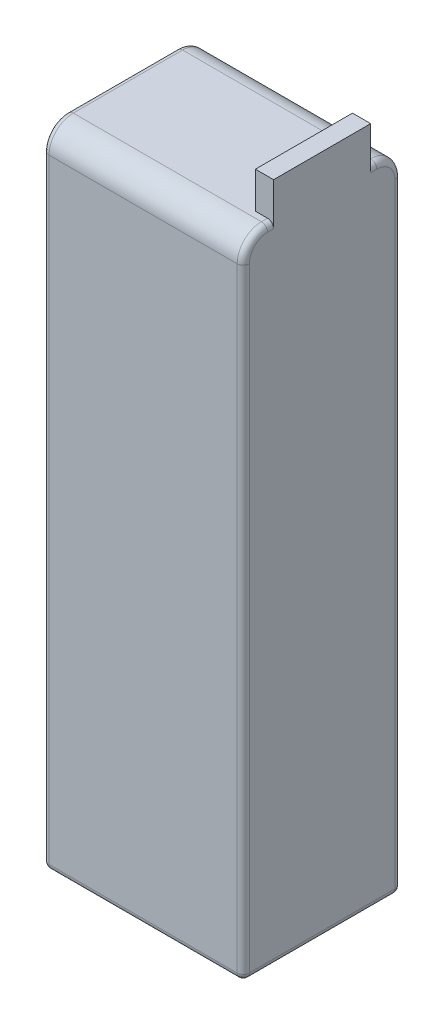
ISO-10303-21;
HEADER;
FILE_DESCRIPTION(('STEP AP214'),'2;1');
FILE_NAME('part.step','',(''),(''),'','','');
FILE_SCHEMA(('AUTOMOTIVE_DESIGN { 1 0 10303 214 1 1 1 1 }'));
ENDSEC;
DATA;
#1=APPLICATION_CONTEXT('core data for automotive mechanical design processes');
#2=APPLICATION_PROTOCOL_DEFINITION('international standard','automotive_design',2000,#1);
#3=PRODUCT_CONTEXT('',#1,'mechanical');
#4=PRODUCT('Part','Part','',(#3));
#5=PRODUCT_RELATED_PRODUCT_CATEGORY('part','',(#4));
#6=PRODUCT_DEFINITION_FORMATION('','',#4);
#7=PRODUCT_DEFINITION_CONTEXT('part definition',#1,'design');
#8=PRODUCT_DEFINITION('design','',#6,#7);
#9=PRODUCT_DEFINITION_SHAPE('','',#8);
#10=(LENGTH_UNIT() NAMED_UNIT(*) SI_UNIT(.MILLI.,.METRE.));
#11=(NAMED_UNIT(*) PLANE_ANGLE_UNIT() SI_UNIT($,.RADIAN.));
#12=(NAMED_UNIT(*) SI_UNIT($,.STERADIAN.) SOLID_ANGLE_UNIT());
#13=UNCERTAINTY_MEASURE_WITH_UNIT(LENGTH_MEASURE(1.E-05),#10,'distance_accuracy_value','');
#14=(GEOMETRIC_REPRESENTATION_CONTEXT(3) GLOBAL_UNCERTAINTY_ASSIGNED_CONTEXT((#13)) GLOBAL_UNIT_ASSIGNED_CONTEXT((#10,
#11,#12)) REPRESENTATION_CONTEXT('',''));
#15=CARTESIAN_POINT('',(0.,0.,0.));
#16=DIRECTION('',(0.,0.,1.));
#17=DIRECTION('',(1.,0.,0.));
#18=AXIS2_PLACEMENT_3D('',#15,#16,#17);
#19=CARTESIAN_POINT('',(0.,67.437,0.));
#20=DIRECTION('',(0.,-1.,0.));
#21=DIRECTION('',(0.,0.,-1.));
#22=AXIS2_PLACEMENT_3D('',#19,#20,#21);
#23=PLANE('',#22);
#24=DIRECTION('',(-1.,0.,0.));
#25=VECTOR('',#24,1.);
#26=CARTESIAN_POINT('',(20.955,67.437,-10.16));
#27=LINE('',#26,#25);
#28=CARTESIAN_POINT('',(19.685,67.437,-10.16));
#29=VERTEX_POINT('',#28);
#30=CARTESIAN_POINT('',(17.145,67.437,-10.16));
#31=VERTEX_POINT('',#30);
#32=EDGE_CURVE('E334',#29,#31,#27,.T.);
#33=ORIENTED_EDGE('',*,*,#32,.F.);
#34=DIRECTION('',(0.,0.,-1.));
#35=VECTOR('',#34,1.);
#36=CARTESIAN_POINT('',(19.685,67.437,0.));
#37=LINE('',#36,#35);
#38=CARTESIAN_POINT('',(19.685,67.437,-11.43));
#39=VERTEX_POINT('',#38);
#40=EDGE_CURVE('E220',#29,#39,#37,.T.);
#41=ORIENTED_EDGE('',*,*,#40,.T.);
#42=DIRECTION('',(-1.,0.,0.));
#43=VECTOR('',#42,1.);
#44=CARTESIAN_POINT('',(0.,67.437,-11.43));
#45=LINE('',#44,#43);
#46=CARTESIAN_POINT('',(-19.685,67.437,-11.43));
#47=VERTEX_POINT('',#46);
#48=EDGE_CURVE('E203',#39,#47,#45,.T.);
#49=ORIENTED_EDGE('',*,*,#48,.T.);
#50=DIRECTION('',(0.,0.,1.));
#51=VECTOR('',#50,1.);
#52=CARTESIAN_POINT('',(-19.685,67.437,0.));
#53=LINE('',#52,#51);
#54=CARTESIAN_POINT('',(-19.685,67.437,11.43));
#55=VERTEX_POINT('',#54);
#56=EDGE_CURVE('E218',#47,#55,#53,.T.);
#57=ORIENTED_EDGE('',*,*,#56,.T.);
#58=DIRECTION('',(1.,0.,0.));
#59=VECTOR('',#58,1.);
#60=CARTESIAN_POINT('',(0.,67.437,11.43));
#61=LINE('',#60,#59);
#62=CARTESIAN_POINT('',(19.685,67.437,11.43));
#63=VERTEX_POINT('',#62);
#64=EDGE_CURVE('E200',#55,#63,#61,.T.);
#65=ORIENTED_EDGE('',*,*,#64,.T.);
#66=DIRECTION('',(0.,0.,-1.));
#67=VECTOR('',#66,1.);
#68=CARTESIAN_POINT('',(19.685,67.437,0.));
#69=LINE('',#68,#67);
#70=CARTESIAN_POINT('',(19.685,67.437,10.16));
#71=VERTEX_POINT('',#70);
#72=EDGE_CURVE('E216',#63,#71,#69,.T.);
#73=ORIENTED_EDGE('',*,*,#72,.T.);
#74=DIRECTION('',(1.,0.,0.));
#75=VECTOR('',#74,1.);
#76=CARTESIAN_POINT('',(20.955,67.437,10.16));
#77=LINE('',#76,#75);
#78=CARTESIAN_POINT('',(17.145,67.437,10.16));
#79=VERTEX_POINT('',#78);
#80=EDGE_CURVE('E194',#79,#71,#77,.T.);
#81=ORIENTED_EDGE('',*,*,#80,.F.);
#82=DIRECTION('',(0.,0.,1.));
#83=VECTOR('',#82,1.);
#84=CARTESIAN_POINT('',(17.145,67.437,-10.16));
#85=LINE('',#84,#83);
#86=EDGE_CURVE('E339',#31,#79,#85,.T.);
#87=ORIENTED_EDGE('',*,*,#86,.F.);
#88=EDGE_LOOP('',(#33,#41,#49,#57,#65,#73,#81,#87));
#89=FACE_BOUND('',#88,.T.);
#90=ADVANCED_FACE('F43',(#89),#23,.F.);
#91=CARTESIAN_POINT('',(20.955,67.437,16.51));
#92=DIRECTION('',(-1.,0.,0.));
#93=DIRECTION('',(0.,0.,1.));
#94=AXIS2_PLACEMENT_3D('',#91,#92,#93);
#95=PLANE('',#94);
#96=DIRECTION('',(0.,0.,-1.));
#97=VECTOR('',#96,1.);
#98=CARTESIAN_POINT('',(20.955,66.167,16.51));
#99=LINE('',#98,#97);
#100=CARTESIAN_POINT('',(20.955,66.167,-11.43));
#101=VERTEX_POINT('',#100);
#102=CARTESIAN_POINT('',(20.955,66.167,-10.16));
#103=VERTEX_POINT('',#102);
#104=EDGE_CURVE('E198',#101,#103,#99,.F.);
#105=ORIENTED_EDGE('',*,*,#104,.T.);
#106=DIRECTION('',(0.,-1.,0.));
#107=VECTOR('',#106,1.);
#108=CARTESIAN_POINT('',(20.955,75.057,-10.16));
#109=LINE('',#108,#107);
#110=CARTESIAN_POINT('',(20.955,75.057,-10.16));
#111=VERTEX_POINT('',#110);
#112=EDGE_CURVE('E179',#111,#103,#109,.T.);
#113=ORIENTED_EDGE('',*,*,#112,.F.);
#114=DIRECTION('',(0.,0.,-1.));
#115=VECTOR('',#114,1.);
#116=CARTESIAN_POINT('',(20.955,75.057,-10.16));
#117=LINE('',#116,#115);
#118=CARTESIAN_POINT('',(20.955,75.057,10.16));
#119=VERTEX_POINT('',#118);
#120=EDGE_CURVE('E186',#119,#111,#117,.T.);
#121=ORIENTED_EDGE('',*,*,#120,.F.);
#122=DIRECTION('',(0.,-1.,0.));
#123=VECTOR('',#122,1.);
#124=CARTESIAN_POINT('',(20.955,75.057,10.16));
#125=LINE('',#124,#123);
#126=CARTESIAN_POINT('',(20.955,66.167,10.16));
#127=VERTEX_POINT('',#126);
#128=EDGE_CURVE('E350',#119,#127,#125,.T.);
#129=ORIENTED_EDGE('',*,*,#128,.T.);
#130=DIRECTION('',(0.,0.,-1.));
#131=VECTOR('',#130,1.);
#132=CARTESIAN_POINT('',(20.955,66.167,16.51));
#133=LINE('',#132,#131);
#134=CARTESIAN_POINT('',(20.955,66.167,11.43));
#135=VERTEX_POINT('',#134);
#136=EDGE_CURVE('E231',#127,#135,#133,.F.);
#137=ORIENTED_EDGE('',*,*,#136,.T.);
#138=CARTESIAN_POINT('',(20.955,62.357,11.43));
#139=DIRECTION('',(-1.,0.,0.));
#140=DIRECTION('',(0.,0.,1.));
#141=AXIS2_PLACEMENT_3D('',#138,#139,#140);
#142=CIRCLE('',#141,3.81);
#143=CARTESIAN_POINT('',(20.955,62.357,15.24));
#144=VERTEX_POINT('',#143);
#145=EDGE_CURVE('E229',#135,#144,#142,.F.);
#146=ORIENTED_EDGE('',*,*,#145,.T.);
#147=DIRECTION('',(0.,-1.,0.));
#148=VECTOR('',#147,1.);
#149=CARTESIAN_POINT('',(20.955,67.437,15.24));
#150=LINE('',#149,#148);
#151=CARTESIAN_POINT('',(20.955,-66.167,15.24));
#152=VERTEX_POINT('',#151);
#153=EDGE_CURVE('E225',#144,#152,#150,.T.);
#154=ORIENTED_EDGE('',*,*,#153,.T.);
#155=DIRECTION('',(0.,0.,-1.));
#156=VECTOR('',#155,1.);
#157=CARTESIAN_POINT('',(20.955,-66.167,-16.51));
#158=LINE('',#157,#156);
#159=CARTESIAN_POINT('',(20.955,-66.167,-15.24));
#160=VERTEX_POINT('',#159);
#161=EDGE_CURVE('E223',#152,#160,#158,.T.);
#162=ORIENTED_EDGE('',*,*,#161,.T.);
#163=DIRECTION('',(0.,-1.,0.));
#164=VECTOR('',#163,1.);
#165=CARTESIAN_POINT('',(20.955,67.437,-15.24));
#166=LINE('',#165,#164);
#167=CARTESIAN_POINT('',(20.955,62.357,-15.24));
#168=VERTEX_POINT('',#167);
#169=EDGE_CURVE('E227',#160,#168,#166,.F.);
#170=ORIENTED_EDGE('',*,*,#169,.T.);
#171=CARTESIAN_POINT('',(20.955,62.357,-11.43));
#172=DIRECTION('',(-1.,0.,0.));
#173=DIRECTION('',(0.,0.,1.));
#174=AXIS2_PLACEMENT_3D('',#171,#172,#173);
#175=CIRCLE('',#174,3.81);
#176=EDGE_CURVE('E233',#168,#101,#175,.F.);
#177=ORIENTED_EDGE('',*,*,#176,.T.);
#178=EDGE_LOOP('',(#105,#113,#121,#129,#137,#146,#154,#162,#170,#177));
#179=FACE_BOUND('',#178,.T.);
#180=ADVANCED_FACE('F196',(#179),#95,.F.);
#181=CARTESIAN_POINT('',(-20.955,67.437,-16.51));
#182=DIRECTION('',(0.,0.,1.));
#183=DIRECTION('',(1.,0.,0.));
#184=AXIS2_PLACEMENT_3D('',#181,#182,#183);
#185=PLANE('',#184);
#186=DIRECTION('',(-1.,0.,0.));
#187=VECTOR('',#186,1.);
#188=CARTESIAN_POINT('',(-20.955,62.357,-16.51));
#189=LINE('',#188,#187);
#190=CARTESIAN_POINT('',(-19.685,62.357,-16.51));
#191=VERTEX_POINT('',#190);
#192=CARTESIAN_POINT('',(19.685,62.357,-16.51));
#193=VERTEX_POINT('',#192);
#194=EDGE_CURVE('E211',#191,#193,#189,.F.);
#195=ORIENTED_EDGE('',*,*,#194,.T.);
#196=DIRECTION('',(0.,-1.,0.));
#197=VECTOR('',#196,1.);
#198=CARTESIAN_POINT('',(19.685,67.437,-16.51));
#199=LINE('',#198,#197);
#200=CARTESIAN_POINT('',(19.685,-66.167,-16.51));
#201=VERTEX_POINT('',#200);
#202=EDGE_CURVE('E261',#193,#201,#199,.T.);
#203=ORIENTED_EDGE('',*,*,#202,.T.);
#204=DIRECTION('',(-1.,0.,0.));
#205=VECTOR('',#204,1.);
#206=CARTESIAN_POINT('',(-20.955,-66.167,-16.51));
#207=LINE('',#206,#205);
#208=CARTESIAN_POINT('',(-19.685,-66.167,-16.51));
#209=VERTEX_POINT('',#208);
#210=EDGE_CURVE('E259',#201,#209,#207,.T.);
#211=ORIENTED_EDGE('',*,*,#210,.T.);
#212=DIRECTION('',(0.,-1.,0.));
#213=VECTOR('',#212,1.);
#214=CARTESIAN_POINT('',(-19.685,67.437,-16.51));
#215=LINE('',#214,#213);
#216=EDGE_CURVE('E257',#209,#191,#215,.F.);
#217=ORIENTED_EDGE('',*,*,#216,.T.);
#218=EDGE_LOOP('',(#195,#203,#211,#217));
#219=FACE_BOUND('',#218,.T.);
#220=ADVANCED_FACE('F444',(#219),#185,.F.);
#221=CARTESIAN_POINT('',(-20.955,67.437,16.51));
#222=DIRECTION('',(1.,0.,0.));
#223=DIRECTION('',(0.,0.,-1.));
#224=AXIS2_PLACEMENT_3D('',#221,#222,#223);
#225=PLANE('',#224);
#226=DIRECTION('',(0.,0.,1.));
#227=VECTOR('',#226,1.);
#228=CARTESIAN_POINT('',(-20.955,66.167,16.51));
#229=LINE('',#228,#227);
#230=CARTESIAN_POINT('',(-20.955,66.167,11.43));
#231=VERTEX_POINT('',#230);
#232=CARTESIAN_POINT('',(-20.955,66.167,-11.43));
#233=VERTEX_POINT('',#232);
#234=EDGE_CURVE('E248',#231,#233,#229,.F.);
#235=ORIENTED_EDGE('',*,*,#234,.T.);
#236=CARTESIAN_POINT('',(-20.955,62.357,-11.43));
#237=DIRECTION('',(1.,0.,0.));
#238=DIRECTION('',(0.,0.,-1.));
#239=AXIS2_PLACEMENT_3D('',#236,#237,#238);
#240=CIRCLE('',#239,3.81);
#241=CARTESIAN_POINT('',(-20.955,62.357,-15.24));
#242=VERTEX_POINT('',#241);
#243=EDGE_CURVE('E250',#233,#242,#240,.F.);
#244=ORIENTED_EDGE('',*,*,#243,.T.);
#245=DIRECTION('',(0.,-1.,0.));
#246=VECTOR('',#245,1.);
#247=CARTESIAN_POINT('',(-20.955,67.437,-15.24));
#248=LINE('',#247,#246);
#249=CARTESIAN_POINT('',(-20.955,-66.167,-15.24));
#250=VERTEX_POINT('',#249);
#251=EDGE_CURVE('E244',#242,#250,#248,.T.);
#252=ORIENTED_EDGE('',*,*,#251,.T.);
#253=DIRECTION('',(0.,0.,1.));
#254=VECTOR('',#253,1.);
#255=CARTESIAN_POINT('',(-20.955,-66.167,16.51));
#256=LINE('',#255,#254);
#257=CARTESIAN_POINT('',(-20.955,-66.167,15.24));
#258=VERTEX_POINT('',#257);
#259=EDGE_CURVE('E240',#250,#258,#256,.T.);
#260=ORIENTED_EDGE('',*,*,#259,.T.);
#261=DIRECTION('',(0.,-1.,0.));
#262=VECTOR('',#261,1.);
#263=CARTESIAN_POINT('',(-20.955,67.437,15.24));
#264=LINE('',#263,#262);
#265=CARTESIAN_POINT('',(-20.955,62.357,15.24));
#266=VERTEX_POINT('',#265);
#267=EDGE_CURVE('E242',#258,#266,#264,.F.);
#268=ORIENTED_EDGE('',*,*,#267,.T.);
#269=CARTESIAN_POINT('',(-20.955,62.357,11.43));
#270=DIRECTION('',(1.,0.,0.));
#271=DIRECTION('',(0.,0.,-1.));
#272=AXIS2_PLACEMENT_3D('',#269,#270,#271);
#273=CIRCLE('',#272,3.81);
#274=EDGE_CURVE('E246',#266,#231,#273,.F.);
#275=ORIENTED_EDGE('',*,*,#274,.T.);
#276=EDGE_LOOP('',(#235,#244,#252,#260,#268,#275));
#277=FACE_BOUND('',#276,.T.);
#278=ADVANCED_FACE('F416',(#277),#225,.F.);
#279=CARTESIAN_POINT('',(-20.955,67.437,16.51));
#280=DIRECTION('',(0.,0.,-1.));
#281=DIRECTION('',(-1.,0.,0.));
#282=AXIS2_PLACEMENT_3D('',#279,#280,#281);
#283=PLANE('',#282);
#284=DIRECTION('',(1.,0.,0.));
#285=VECTOR('',#284,1.);
#286=CARTESIAN_POINT('',(-20.955,62.357,16.51));
#287=LINE('',#286,#285);
#288=CARTESIAN_POINT('',(19.685,62.357,16.51));
#289=VERTEX_POINT('',#288);
#290=CARTESIAN_POINT('',(-19.685,62.357,16.51));
#291=VERTEX_POINT('',#290);
#292=EDGE_CURVE('E214',#289,#291,#287,.F.);
#293=ORIENTED_EDGE('',*,*,#292,.T.);
#294=DIRECTION('',(0.,-1.,0.));
#295=VECTOR('',#294,1.);
#296=CARTESIAN_POINT('',(-19.685,67.437,16.51));
#297=LINE('',#296,#295);
#298=CARTESIAN_POINT('',(-19.685,-66.167,16.51));
#299=VERTEX_POINT('',#298);
#300=EDGE_CURVE('E60',#291,#299,#297,.T.);
#301=ORIENTED_EDGE('',*,*,#300,.T.);
#302=DIRECTION('',(1.,0.,0.));
#303=VECTOR('',#302,1.);
#304=CARTESIAN_POINT('',(20.955,-66.167,16.51));
#305=LINE('',#304,#303);
#306=CARTESIAN_POINT('',(19.685,-66.167,16.51));
#307=VERTEX_POINT('',#306);
#308=EDGE_CURVE('E65',#299,#307,#305,.T.);
#309=ORIENTED_EDGE('',*,*,#308,.T.);
#310=DIRECTION('',(0.,-1.,0.));
#311=VECTOR('',#310,1.);
#312=CARTESIAN_POINT('',(19.685,67.437,16.51));
#313=LINE('',#312,#311);
#314=EDGE_CURVE('E272',#307,#289,#313,.F.);
#315=ORIENTED_EDGE('',*,*,#314,.T.);
#316=EDGE_LOOP('',(#293,#301,#309,#315));
#317=FACE_BOUND('',#316,.T.);
#318=ADVANCED_FACE('F434',(#317),#283,.F.);
#319=CARTESIAN_POINT('',(0.,-67.437,0.));
#320=DIRECTION('',(0.,-1.,0.));
#321=DIRECTION('',(0.,0.,-1.));
#322=AXIS2_PLACEMENT_3D('',#319,#320,#321);
#323=PLANE('',#322);
#324=DIRECTION('',(1.,0.,0.));
#325=VECTOR('',#324,1.);
#326=CARTESIAN_POINT('',(-20.955,-67.437,15.24));
#327=LINE('',#326,#325);
#328=CARTESIAN_POINT('',(19.685,-67.437,15.24));
#329=VERTEX_POINT('',#328);
#330=CARTESIAN_POINT('',(-19.685,-67.437,15.24));
#331=VERTEX_POINT('',#330);
#332=EDGE_CURVE('E265',#329,#331,#327,.F.);
#333=ORIENTED_EDGE('',*,*,#332,.T.);
#334=DIRECTION('',(0.,0.,1.));
#335=VECTOR('',#334,1.);
#336=CARTESIAN_POINT('',(-19.685,-67.437,-16.51));
#337=LINE('',#336,#335);
#338=CARTESIAN_POINT('',(-19.685,-67.437,-15.24));
#339=VERTEX_POINT('',#338);
#340=EDGE_CURVE('E270',#331,#339,#337,.F.);
#341=ORIENTED_EDGE('',*,*,#340,.T.);
#342=DIRECTION('',(-1.,0.,0.));
#343=VECTOR('',#342,1.);
#344=CARTESIAN_POINT('',(20.955,-67.437,-15.24));
#345=LINE('',#344,#343);
#346=CARTESIAN_POINT('',(19.685,-67.437,-15.24));
#347=VERTEX_POINT('',#346);
#348=EDGE_CURVE('E267',#339,#347,#345,.F.);
#349=ORIENTED_EDGE('',*,*,#348,.T.);
#350=DIRECTION('',(0.,0.,-1.));
#351=VECTOR('',#350,1.);
#352=CARTESIAN_POINT('',(19.685,-67.437,16.51));
#353=LINE('',#352,#351);
#354=EDGE_CURVE('E263',#347,#329,#353,.F.);
#355=ORIENTED_EDGE('',*,*,#354,.T.);
#356=EDGE_LOOP('',(#333,#341,#349,#355));
#357=FACE_BOUND('',#356,.T.);
#358=ADVANCED_FACE('F436',(#357),#323,.T.);
#359=CARTESIAN_POINT('',(20.955,75.057,-10.16));
#360=DIRECTION('',(0.,0.,1.));
#361=DIRECTION('',(1.,0.,0.));
#362=AXIS2_PLACEMENT_3D('',#359,#360,#361);
#363=PLANE('',#362);
#364=ORIENTED_EDGE('',*,*,#112,.T.);
#365=CARTESIAN_POINT('',(19.685,66.167,-10.16));
#366=DIRECTION('',(0.,0.,1.));
#367=DIRECTION('',(1.,0.,0.));
#368=AXIS2_PLACEMENT_3D('',#365,#366,#367);
#369=CIRCLE('',#368,1.27);
#370=EDGE_CURVE('E52',#103,#29,#369,.T.);
#371=ORIENTED_EDGE('',*,*,#370,.T.);
#372=ORIENTED_EDGE('',*,*,#32,.T.);
#373=DIRECTION('',(0.,-1.,0.));
#374=VECTOR('',#373,1.);
#375=CARTESIAN_POINT('',(17.145,75.057,-10.16));
#376=LINE('',#375,#374);
#377=CARTESIAN_POINT('',(17.145,75.057,-10.16));
#378=VERTEX_POINT('',#377);
#379=EDGE_CURVE('E182',#378,#31,#376,.T.);
#380=ORIENTED_EDGE('',*,*,#379,.F.);
#381=DIRECTION('',(-1.,0.,0.));
#382=VECTOR('',#381,1.);
#383=CARTESIAN_POINT('',(20.955,75.057,-10.16));
#384=LINE('',#383,#382);
#385=EDGE_CURVE('E175',#111,#378,#384,.T.);
#386=ORIENTED_EDGE('',*,*,#385,.F.);
#387=EDGE_LOOP('',(#364,#371,#372,#380,#386));
#388=FACE_BOUND('',#387,.T.);
#389=ADVANCED_FACE('F177',(#388),#363,.F.);
#390=CARTESIAN_POINT('',(17.145,75.057,-10.16));
#391=DIRECTION('',(1.,0.,0.));
#392=DIRECTION('',(0.,0.,-1.));
#393=AXIS2_PLACEMENT_3D('',#390,#391,#392);
#394=PLANE('',#393);
#395=ORIENTED_EDGE('',*,*,#86,.T.);
#396=DIRECTION('',(0.,-1.,0.));
#397=VECTOR('',#396,1.);
#398=CARTESIAN_POINT('',(17.145,75.057,10.16));
#399=LINE('',#398,#397);
#400=CARTESIAN_POINT('',(17.145,75.057,10.16));
#401=VERTEX_POINT('',#400);
#402=EDGE_CURVE('E205',#401,#79,#399,.T.);
#403=ORIENTED_EDGE('',*,*,#402,.F.);
#404=DIRECTION('',(0.,0.,1.));
#405=VECTOR('',#404,1.);
#406=CARTESIAN_POINT('',(17.145,75.057,-10.16));
#407=LINE('',#406,#405);
#408=EDGE_CURVE('E185',#378,#401,#407,.T.);
#409=ORIENTED_EDGE('',*,*,#408,.F.);
#410=ORIENTED_EDGE('',*,*,#379,.T.);
#411=EDGE_LOOP('',(#395,#403,#409,#410));
#412=FACE_BOUND('',#411,.T.);
#413=ADVANCED_FACE('F357',(#412),#394,.F.);
#414=CARTESIAN_POINT('',(20.955,75.057,10.16));
#415=DIRECTION('',(0.,0.,-1.));
#416=DIRECTION('',(-1.,0.,0.));
#417=AXIS2_PLACEMENT_3D('',#414,#415,#416);
#418=PLANE('',#417);
#419=ORIENTED_EDGE('',*,*,#80,.T.);
#420=CARTESIAN_POINT('',(19.685,66.167,10.16));
#421=DIRECTION('',(0.,0.,-1.));
#422=DIRECTION('',(-1.,0.,0.));
#423=AXIS2_PLACEMENT_3D('',#420,#421,#422);
#424=CIRCLE('',#423,1.27);
#425=EDGE_CURVE('E11',#71,#127,#424,.T.);
#426=ORIENTED_EDGE('',*,*,#425,.T.);
#427=ORIENTED_EDGE('',*,*,#128,.F.);
#428=DIRECTION('',(1.,0.,0.));
#429=VECTOR('',#428,1.);
#430=CARTESIAN_POINT('',(20.955,75.057,10.16));
#431=LINE('',#430,#429);
#432=EDGE_CURVE('E191',#401,#119,#431,.T.);
#433=ORIENTED_EDGE('',*,*,#432,.F.);
#434=ORIENTED_EDGE('',*,*,#402,.T.);
#435=EDGE_LOOP('',(#419,#426,#427,#433,#434));
#436=FACE_BOUND('',#435,.T.);
#437=ADVANCED_FACE('F354',(#436),#418,.F.);
#438=CARTESIAN_POINT('',(0.,75.057,0.));
#439=DIRECTION('',(0.,-1.,0.));
#440=DIRECTION('',(0.,0.,-1.));
#441=AXIS2_PLACEMENT_3D('',#438,#439,#440);
#442=PLANE('',#441);
#443=ORIENTED_EDGE('',*,*,#120,.T.);
#444=ORIENTED_EDGE('',*,*,#385,.T.);
#445=ORIENTED_EDGE('',*,*,#408,.T.);
#446=ORIENTED_EDGE('',*,*,#432,.T.);
#447=EDGE_LOOP('',(#443,#444,#445,#446));
#448=FACE_BOUND('',#447,.T.);
#449=ADVANCED_FACE('F189',(#448),#442,.F.);
#450=CARTESIAN_POINT('',(0.,62.357,-11.43));
#451=DIRECTION('',(-1.,0.,0.));
#452=DIRECTION('',(0.,0.,1.));
#453=AXIS2_PLACEMENT_3D('',#450,#451,#452);
#454=CYLINDRICAL_SURFACE('',#453,5.08);
#455=ORIENTED_EDGE('',*,*,#48,.F.);
#456=CARTESIAN_POINT('',(19.685,62.357,-11.43));
#457=DIRECTION('',(-1.,0.,0.));
#458=DIRECTION('',(0.,0.,1.));
#459=AXIS2_PLACEMENT_3D('',#456,#457,#458);
#460=CIRCLE('',#459,5.08);
#461=EDGE_CURVE('E238',#39,#193,#460,.T.);
#462=ORIENTED_EDGE('',*,*,#461,.T.);
#463=ORIENTED_EDGE('',*,*,#194,.F.);
#464=CARTESIAN_POINT('',(-19.685,62.357,-11.43));
#465=DIRECTION('',(1.,0.,0.));
#466=DIRECTION('',(0.,0.,-1.));
#467=AXIS2_PLACEMENT_3D('',#464,#465,#466);
#468=CIRCLE('',#467,5.08);
#469=EDGE_CURVE('E236',#191,#47,#468,.T.);
#470=ORIENTED_EDGE('',*,*,#469,.T.);
#471=EDGE_LOOP('',(#455,#462,#463,#470));
#472=FACE_BOUND('',#471,.T.);
#473=ADVANCED_FACE('F403',(#472),#454,.T.);
#474=CARTESIAN_POINT('',(0.,62.357,11.43));
#475=DIRECTION('',(1.,0.,0.));
#476=DIRECTION('',(0.,0.,-1.));
#477=AXIS2_PLACEMENT_3D('',#474,#475,#476);
#478=CYLINDRICAL_SURFACE('',#477,5.08);
#479=ORIENTED_EDGE('',*,*,#64,.F.);
#480=CARTESIAN_POINT('',(-19.685,62.357,11.43));
#481=DIRECTION('',(1.,0.,0.));
#482=DIRECTION('',(0.,0.,-1.));
#483=AXIS2_PLACEMENT_3D('',#480,#481,#482);
#484=CIRCLE('',#483,5.08);
#485=EDGE_CURVE('E255',#55,#291,#484,.T.);
#486=ORIENTED_EDGE('',*,*,#485,.T.);
#487=ORIENTED_EDGE('',*,*,#292,.F.);
#488=CARTESIAN_POINT('',(19.685,62.357,11.43));
#489=DIRECTION('',(-1.,0.,0.));
#490=DIRECTION('',(0.,0.,1.));
#491=AXIS2_PLACEMENT_3D('',#488,#489,#490);
#492=CIRCLE('',#491,5.08);
#493=EDGE_CURVE('E253',#289,#63,#492,.T.);
#494=ORIENTED_EDGE('',*,*,#493,.T.);
#495=EDGE_LOOP('',(#479,#486,#487,#494));
#496=FACE_BOUND('',#495,.T.);
#497=ADVANCED_FACE('F432',(#496),#478,.T.);
#498=CARTESIAN_POINT('',(-19.685,62.357,11.43));
#499=DIRECTION('',(1.,0.,0.));
#500=DIRECTION('',(0.,0.,-1.));
#501=AXIS2_PLACEMENT_3D('',#498,#499,#500);
#502=TOROIDAL_SURFACE('',#501,3.81,1.27);
#503=CARTESIAN_POINT('',(-19.685,62.357,15.24));
#504=DIRECTION('',(0.,-1.,0.));
#505=DIRECTION('',(0.,0.,-1.));
#506=AXIS2_PLACEMENT_3D('',#503,#504,#505);
#507=CIRCLE('',#506,1.27);
#508=EDGE_CURVE('E328',#291,#266,#507,.T.);
#509=ORIENTED_EDGE('',*,*,#508,.F.);
#510=ORIENTED_EDGE('',*,*,#485,.F.);
#511=CARTESIAN_POINT('',(-19.685,66.167,11.43));
#512=DIRECTION('',(0.,0.,-1.));
#513=DIRECTION('',(-1.,0.,0.));
#514=AXIS2_PLACEMENT_3D('',#511,#512,#513);
#515=CIRCLE('',#514,1.27);
#516=EDGE_CURVE('E47',#231,#55,#515,.T.);
#517=ORIENTED_EDGE('',*,*,#516,.F.);
#518=ORIENTED_EDGE('',*,*,#274,.F.);
#519=EDGE_LOOP('',(#509,#510,#517,#518));
#520=FACE_BOUND('',#519,.T.);
#521=ADVANCED_FACE('F45',(#520),#502,.T.);
#522=CARTESIAN_POINT('',(-19.685,66.167,0.));
#523=DIRECTION('',(0.,0.,1.));
#524=DIRECTION('',(1.,0.,0.));
#525=AXIS2_PLACEMENT_3D('',#522,#523,#524);
#526=CYLINDRICAL_SURFACE('',#525,1.27);
#527=ORIENTED_EDGE('',*,*,#516,.T.);
#528=ORIENTED_EDGE('',*,*,#56,.F.);
#529=CARTESIAN_POINT('',(-19.685,66.167,-11.43));
#530=DIRECTION('',(0.,0.,-1.));
#531=DIRECTION('',(-1.,0.,0.));
#532=AXIS2_PLACEMENT_3D('',#529,#530,#531);
#533=CIRCLE('',#532,1.27);
#534=EDGE_CURVE('E326',#233,#47,#533,.T.);
#535=ORIENTED_EDGE('',*,*,#534,.F.);
#536=ORIENTED_EDGE('',*,*,#234,.F.);
#537=EDGE_LOOP('',(#527,#528,#535,#536));
#538=FACE_BOUND('',#537,.T.);
#539=ADVANCED_FACE('F430',(#538),#526,.T.);
#540=CARTESIAN_POINT('',(-19.685,67.437,15.24));
#541=DIRECTION('',(0.,-1.,0.));
#542=DIRECTION('',(0.,0.,-1.));
#543=AXIS2_PLACEMENT_3D('',#540,#541,#542);
#544=CYLINDRICAL_SURFACE('',#543,1.27);
#545=ORIENTED_EDGE('',*,*,#508,.T.);
#546=ORIENTED_EDGE('',*,*,#267,.F.);
#547=CARTESIAN_POINT('',(-19.685,-66.167,15.24));
#548=DIRECTION('',(0.,-1.,0.));
#549=DIRECTION('',(0.,0.,-1.));
#550=AXIS2_PLACEMENT_3D('',#547,#548,#549);
#551=CIRCLE('',#550,1.27);
#552=EDGE_CURVE('E323',#299,#258,#551,.T.);
#553=ORIENTED_EDGE('',*,*,#552,.F.);
#554=ORIENTED_EDGE('',*,*,#300,.F.);
#555=EDGE_LOOP('',(#545,#546,#553,#554));
#556=FACE_BOUND('',#555,.T.);
#557=ADVANCED_FACE('F426',(#556),#544,.T.);
#558=CARTESIAN_POINT('',(19.685,66.167,0.));
#559=DIRECTION('',(0.,0.,-1.));
#560=DIRECTION('',(-1.,0.,0.));
#561=AXIS2_PLACEMENT_3D('',#558,#559,#560);
#562=CYLINDRICAL_SURFACE('',#561,1.27);
#563=ORIENTED_EDGE('',*,*,#425,.F.);
#564=ORIENTED_EDGE('',*,*,#72,.F.);
#565=CARTESIAN_POINT('',(19.685,66.167,11.43));
#566=DIRECTION('',(0.,0.,1.));
#567=DIRECTION('',(1.,0.,0.));
#568=AXIS2_PLACEMENT_3D('',#565,#566,#567);
#569=CIRCLE('',#568,1.27);
#570=EDGE_CURVE('E320',#135,#63,#569,.T.);
#571=ORIENTED_EDGE('',*,*,#570,.F.);
#572=ORIENTED_EDGE('',*,*,#136,.F.);
#573=EDGE_LOOP('',(#563,#564,#571,#572));
#574=FACE_BOUND('',#573,.T.);
#575=ADVANCED_FACE('F364',(#574),#562,.T.);
#576=CARTESIAN_POINT('',(-19.685,62.357,-11.43));
#577=DIRECTION('',(1.,0.,0.));
#578=DIRECTION('',(0.,0.,-1.));
#579=AXIS2_PLACEMENT_3D('',#576,#577,#578);
#580=TOROIDAL_SURFACE('',#579,3.81,1.27);
#581=ORIENTED_EDGE('',*,*,#534,.T.);
#582=ORIENTED_EDGE('',*,*,#469,.F.);
#583=CARTESIAN_POINT('',(-19.685,62.357,-15.24));
#584=DIRECTION('',(0.,-1.,0.));
#585=DIRECTION('',(0.,0.,-1.));
#586=AXIS2_PLACEMENT_3D('',#583,#584,#585);
#587=CIRCLE('',#586,1.27);
#588=EDGE_CURVE('E317',#242,#191,#587,.T.);
#589=ORIENTED_EDGE('',*,*,#588,.F.);
#590=ORIENTED_EDGE('',*,*,#243,.F.);
#591=EDGE_LOOP('',(#581,#582,#589,#590));
#592=FACE_BOUND('',#591,.T.);
#593=ADVANCED_FACE('F407',(#592),#580,.T.);
#594=CARTESIAN_POINT('',(-19.685,-66.167,15.24));
#595=DIRECTION('',(-1.,0.,0.));
#596=DIRECTION('',(0.,0.,1.));
#597=AXIS2_PLACEMENT_3D('',#594,#595,#596);
#598=SPHERICAL_SURFACE('',#597,1.27);
#599=CARTESIAN_POINT('',(-19.685,-66.167,15.24));
#600=DIRECTION('',(-1.,0.,0.));
#601=DIRECTION('',(0.,0.,1.));
#602=AXIS2_PLACEMENT_3D('',#599,#600,#601);
#603=CIRCLE('',#602,1.27);
#604=EDGE_CURVE('E311',#299,#331,#603,.F.);
#605=ORIENTED_EDGE('',*,*,#604,.F.);
#606=ORIENTED_EDGE('',*,*,#552,.T.);
#607=CARTESIAN_POINT('',(-19.685,-66.167,15.24));
#608=DIRECTION('',(0.,0.,1.));
#609=DIRECTION('',(1.,0.,0.));
#610=AXIS2_PLACEMENT_3D('',#607,#608,#609);
#611=CIRCLE('',#610,1.27);
#612=EDGE_CURVE('E314',#331,#258,#611,.F.);
#613=ORIENTED_EDGE('',*,*,#612,.F.);
#614=EDGE_LOOP('',(#605,#606,#613));
#615=FACE_BOUND('',#614,.T.);
#616=ADVANCED_FACE('F425',(#615),#598,.T.);
#617=CARTESIAN_POINT('',(19.685,62.357,11.43));
#618=DIRECTION('',(-1.,0.,0.));
#619=DIRECTION('',(0.,0.,1.));
#620=AXIS2_PLACEMENT_3D('',#617,#618,#619);
#621=TOROIDAL_SURFACE('',#620,3.81,1.27);
#622=ORIENTED_EDGE('',*,*,#570,.T.);
#623=ORIENTED_EDGE('',*,*,#493,.F.);
#624=CARTESIAN_POINT('',(19.685,62.357,15.24));
#625=DIRECTION('',(0.,-1.,0.));
#626=DIRECTION('',(0.,0.,-1.));
#627=AXIS2_PLACEMENT_3D('',#624,#625,#626);
#628=CIRCLE('',#627,1.27);
#629=EDGE_CURVE('E308',#144,#289,#628,.T.);
#630=ORIENTED_EDGE('',*,*,#629,.F.);
#631=ORIENTED_EDGE('',*,*,#145,.F.);
#632=EDGE_LOOP('',(#622,#623,#630,#631));
#633=FACE_BOUND('',#632,.T.);
#634=ADVANCED_FACE('F369',(#633),#621,.T.);
#635=CARTESIAN_POINT('',(-19.685,67.437,-15.24));
#636=DIRECTION('',(0.,-1.,0.));
#637=DIRECTION('',(0.,0.,-1.));
#638=AXIS2_PLACEMENT_3D('',#635,#636,#637);
#639=CYLINDRICAL_SURFACE('',#638,1.27);
#640=ORIENTED_EDGE('',*,*,#588,.T.);
#641=ORIENTED_EDGE('',*,*,#216,.F.);
#642=CARTESIAN_POINT('',(-19.685,-66.167,-15.24));
#643=DIRECTION('',(0.,-1.,0.));
#644=DIRECTION('',(0.,0.,-1.));
#645=AXIS2_PLACEMENT_3D('',#642,#643,#644);
#646=CIRCLE('',#645,1.27);
#647=EDGE_CURVE('E305',#250,#209,#646,.T.);
#648=ORIENTED_EDGE('',*,*,#647,.F.);
#649=ORIENTED_EDGE('',*,*,#251,.F.);
#650=EDGE_LOOP('',(#640,#641,#648,#649));
#651=FACE_BOUND('',#650,.T.);
#652=ADVANCED_FACE('F412',(#651),#639,.T.);
#653=CARTESIAN_POINT('',(-19.685,-66.167,16.51));
#654=DIRECTION('',(0.,0.,-1.));
#655=DIRECTION('',(-1.,0.,0.));
#656=AXIS2_PLACEMENT_3D('',#653,#654,#655);
#657=CYLINDRICAL_SURFACE('',#656,1.27);
#658=ORIENTED_EDGE('',*,*,#612,.T.);
#659=ORIENTED_EDGE('',*,*,#259,.F.);
#660=CARTESIAN_POINT('',(-19.685,-66.167,-15.24));
#661=DIRECTION('',(0.,0.,-1.));
#662=DIRECTION('',(-1.,0.,0.));
#663=AXIS2_PLACEMENT_3D('',#660,#661,#662);
#664=CIRCLE('',#663,1.27);
#665=EDGE_CURVE('E302',#339,#250,#664,.T.);
#666=ORIENTED_EDGE('',*,*,#665,.F.);
#667=ORIENTED_EDGE('',*,*,#340,.F.);
#668=EDGE_LOOP('',(#658,#659,#666,#667));
#669=FACE_BOUND('',#668,.T.);
#670=ADVANCED_FACE('F419',(#669),#657,.T.);
#671=CARTESIAN_POINT('',(-20.955,-66.167,15.24));
#672=DIRECTION('',(-1.,0.,0.));
#673=DIRECTION('',(0.,0.,1.));
#674=AXIS2_PLACEMENT_3D('',#671,#672,#673);
#675=CYLINDRICAL_SURFACE('',#674,1.27);
#676=ORIENTED_EDGE('',*,*,#604,.T.);
#677=ORIENTED_EDGE('',*,*,#332,.F.);
#678=CARTESIAN_POINT('',(19.685,-66.167,15.24));
#679=DIRECTION('',(1.,0.,0.));
#680=DIRECTION('',(0.,0.,-1.));
#681=AXIS2_PLACEMENT_3D('',#678,#679,#680);
#682=CIRCLE('',#681,1.27);
#683=EDGE_CURVE('E299',#307,#329,#682,.T.);
#684=ORIENTED_EDGE('',*,*,#683,.F.);
#685=ORIENTED_EDGE('',*,*,#308,.F.);
#686=EDGE_LOOP('',(#676,#677,#684,#685));
#687=FACE_BOUND('',#686,.T.);
#688=ADVANCED_FACE('F492',(#687),#675,.T.);
#689=CARTESIAN_POINT('',(19.685,67.437,15.24));
#690=DIRECTION('',(0.,-1.,0.));
#691=DIRECTION('',(0.,0.,-1.));
#692=AXIS2_PLACEMENT_3D('',#689,#690,#691);
#693=CYLINDRICAL_SURFACE('',#692,1.27);
#694=ORIENTED_EDGE('',*,*,#629,.T.);
#695=ORIENTED_EDGE('',*,*,#314,.F.);
#696=CARTESIAN_POINT('',(19.685,-66.167,15.24));
#697=DIRECTION('',(0.,-1.,0.));
#698=DIRECTION('',(0.,0.,-1.));
#699=AXIS2_PLACEMENT_3D('',#696,#697,#698);
#700=CIRCLE('',#699,1.27);
#701=EDGE_CURVE('E296',#152,#307,#700,.T.);
#702=ORIENTED_EDGE('',*,*,#701,.F.);
#703=ORIENTED_EDGE('',*,*,#153,.F.);
#704=EDGE_LOOP('',(#694,#695,#702,#703));
#705=FACE_BOUND('',#704,.T.);
#706=ADVANCED_FACE('F377',(#705),#693,.T.);
#707=CARTESIAN_POINT('',(-19.685,-66.167,-15.24));
#708=DIRECTION('',(-1.,0.,0.));
#709=DIRECTION('',(0.,0.,1.));
#710=AXIS2_PLACEMENT_3D('',#707,#708,#709);
#711=SPHERICAL_SURFACE('',#710,1.27);
#712=ORIENTED_EDGE('',*,*,#665,.T.);
#713=ORIENTED_EDGE('',*,*,#647,.T.);
#714=CARTESIAN_POINT('',(-19.685,-66.167,-15.24));
#715=DIRECTION('',(-1.,0.,0.));
#716=DIRECTION('',(0.,0.,1.));
#717=AXIS2_PLACEMENT_3D('',#714,#715,#716);
#718=CIRCLE('',#717,1.27);
#719=EDGE_CURVE('E293',#339,#209,#718,.F.);
#720=ORIENTED_EDGE('',*,*,#719,.F.);
#721=EDGE_LOOP('',(#712,#713,#720));
#722=FACE_BOUND('',#721,.T.);
#723=ADVANCED_FACE('F486',(#722),#711,.T.);
#724=CARTESIAN_POINT('',(19.685,-66.167,15.24));
#725=DIRECTION('',(0.,0.,1.));
#726=DIRECTION('',(1.,0.,0.));
#727=AXIS2_PLACEMENT_3D('',#724,#725,#726);
#728=SPHERICAL_SURFACE('',#727,1.27);
#729=ORIENTED_EDGE('',*,*,#701,.T.);
#730=ORIENTED_EDGE('',*,*,#683,.T.);
#731=CARTESIAN_POINT('',(19.685,-66.167,15.24));
#732=DIRECTION('',(0.,0.,1.));
#733=DIRECTION('',(1.,0.,0.));
#734=AXIS2_PLACEMENT_3D('',#731,#732,#733);
#735=CIRCLE('',#734,1.27);
#736=EDGE_CURVE('E290',#152,#329,#735,.F.);
#737=ORIENTED_EDGE('',*,*,#736,.F.);
#738=EDGE_LOOP('',(#729,#730,#737));
#739=FACE_BOUND('',#738,.T.);
#740=ADVANCED_FACE('F380',(#739),#728,.T.);
#741=CARTESIAN_POINT('',(-20.955,-66.167,-15.24));
#742=DIRECTION('',(1.,0.,0.));
#743=DIRECTION('',(0.,0.,-1.));
#744=AXIS2_PLACEMENT_3D('',#741,#742,#743);
#745=CYLINDRICAL_SURFACE('',#744,1.27);
#746=ORIENTED_EDGE('',*,*,#719,.T.);
#747=ORIENTED_EDGE('',*,*,#210,.F.);
#748=CARTESIAN_POINT('',(19.685,-66.167,-15.24));
#749=DIRECTION('',(1.,0.,0.));
#750=DIRECTION('',(0.,0.,-1.));
#751=AXIS2_PLACEMENT_3D('',#748,#749,#750);
#752=CIRCLE('',#751,1.27);
#753=EDGE_CURVE('E287',#347,#201,#752,.T.);
#754=ORIENTED_EDGE('',*,*,#753,.F.);
#755=ORIENTED_EDGE('',*,*,#348,.F.);
#756=EDGE_LOOP('',(#746,#747,#754,#755));
#757=FACE_BOUND('',#756,.T.);
#758=ADVANCED_FACE('F480',(#757),#745,.T.);
#759=CARTESIAN_POINT('',(19.685,-66.167,16.51));
#760=DIRECTION('',(0.,0.,1.));
#761=DIRECTION('',(1.,0.,0.));
#762=AXIS2_PLACEMENT_3D('',#759,#760,#761);
#763=CYLINDRICAL_SURFACE('',#762,1.27);
#764=ORIENTED_EDGE('',*,*,#736,.T.);
#765=ORIENTED_EDGE('',*,*,#354,.F.);
#766=CARTESIAN_POINT('',(19.685,-66.167,-15.24));
#767=DIRECTION('',(0.,0.,-1.));
#768=DIRECTION('',(-1.,0.,0.));
#769=AXIS2_PLACEMENT_3D('',#766,#767,#768);
#770=CIRCLE('',#769,1.27);
#771=EDGE_CURVE('E285',#160,#347,#770,.T.);
#772=ORIENTED_EDGE('',*,*,#771,.F.);
#773=ORIENTED_EDGE('',*,*,#161,.F.);
#774=EDGE_LOOP('',(#764,#765,#772,#773));
#775=FACE_BOUND('',#774,.T.);
#776=ADVANCED_FACE('F383',(#775),#763,.T.);
#777=CARTESIAN_POINT('',(19.685,-66.167,-15.24));
#778=DIRECTION('',(0.,-1.,0.));
#779=DIRECTION('',(0.,0.,-1.));
#780=AXIS2_PLACEMENT_3D('',#777,#778,#779);
#781=SPHERICAL_SURFACE('',#780,1.27);
#782=ORIENTED_EDGE('',*,*,#771,.T.);
#783=ORIENTED_EDGE('',*,*,#753,.T.);
#784=CARTESIAN_POINT('',(19.685,-66.167,-15.24));
#785=DIRECTION('',(0.,-1.,0.));
#786=DIRECTION('',(0.,0.,-1.));
#787=AXIS2_PLACEMENT_3D('',#784,#785,#786);
#788=CIRCLE('',#787,1.27);
#789=EDGE_CURVE('E282',#160,#201,#788,.F.);
#790=ORIENTED_EDGE('',*,*,#789,.F.);
#791=EDGE_LOOP('',(#782,#783,#790));
#792=FACE_BOUND('',#791,.T.);
#793=ADVANCED_FACE('F388',(#792),#781,.T.);
#794=CARTESIAN_POINT('',(19.685,67.437,-15.24));
#795=DIRECTION('',(0.,-1.,0.));
#796=DIRECTION('',(0.,0.,-1.));
#797=AXIS2_PLACEMENT_3D('',#794,#795,#796);
#798=CYLINDRICAL_SURFACE('',#797,1.27);
#799=ORIENTED_EDGE('',*,*,#789,.T.);
#800=ORIENTED_EDGE('',*,*,#202,.F.);
#801=CARTESIAN_POINT('',(19.685,62.357,-15.24));
#802=DIRECTION('',(0.,1.,0.));
#803=DIRECTION('',(0.,0.,1.));
#804=AXIS2_PLACEMENT_3D('',#801,#802,#803);
#805=CIRCLE('',#804,1.27);
#806=EDGE_CURVE('E279',#168,#193,#805,.T.);
#807=ORIENTED_EDGE('',*,*,#806,.F.);
#808=ORIENTED_EDGE('',*,*,#169,.F.);
#809=EDGE_LOOP('',(#799,#800,#807,#808));
#810=FACE_BOUND('',#809,.T.);
#811=ADVANCED_FACE('F392',(#810),#798,.T.);
#812=CARTESIAN_POINT('',(19.685,62.357,-11.43));
#813=DIRECTION('',(-1.,0.,0.));
#814=DIRECTION('',(0.,0.,1.));
#815=AXIS2_PLACEMENT_3D('',#812,#813,#814);
#816=TOROIDAL_SURFACE('',#815,3.81,1.27);
#817=ORIENTED_EDGE('',*,*,#806,.T.);
#818=ORIENTED_EDGE('',*,*,#461,.F.);
#819=CARTESIAN_POINT('',(19.685,66.167,-11.43));
#820=DIRECTION('',(0.,0.,1.));
#821=DIRECTION('',(1.,0.,0.));
#822=AXIS2_PLACEMENT_3D('',#819,#820,#821);
#823=CIRCLE('',#822,1.27);
#824=EDGE_CURVE('E277',#101,#39,#823,.T.);
#825=ORIENTED_EDGE('',*,*,#824,.F.);
#826=ORIENTED_EDGE('',*,*,#176,.F.);
#827=EDGE_LOOP('',(#817,#818,#825,#826));
#828=FACE_BOUND('',#827,.T.);
#829=ADVANCED_FACE('F399',(#828),#816,.T.);
#830=CARTESIAN_POINT('',(19.685,66.167,0.));
#831=DIRECTION('',(0.,0.,-1.));
#832=DIRECTION('',(-1.,0.,0.));
#833=AXIS2_PLACEMENT_3D('',#830,#831,#832);
#834=CYLINDRICAL_SURFACE('',#833,1.27);
#835=ORIENTED_EDGE('',*,*,#370,.F.);
#836=ORIENTED_EDGE('',*,*,#104,.F.);
#837=ORIENTED_EDGE('',*,*,#824,.T.);
#838=ORIENTED_EDGE('',*,*,#40,.F.);
#839=EDGE_LOOP('',(#835,#836,#837,#838));
#840=FACE_BOUND('',#839,.T.);
#841=ADVANCED_FACE('F397',(#840),#834,.T.);
#842=CLOSED_SHELL('',(#90,#180,#220,#278,#318,#358,#389,#413,#437,#449,#473,#497,#521,#539,#557,
#575,#593,#616,#634,#652,#670,#688,#706,#723,#740,#758,#776,#793,#811,#829,#841));
#843=MANIFOLD_SOLID_BREP('B2',#842);
#844=ADVANCED_BREP_SHAPE_REPRESENTATION('',(#18,#843),#14);
#845=SHAPE_DEFINITION_REPRESENTATION(#9,#844);
ENDSEC;
END-ISO-10303-21;
